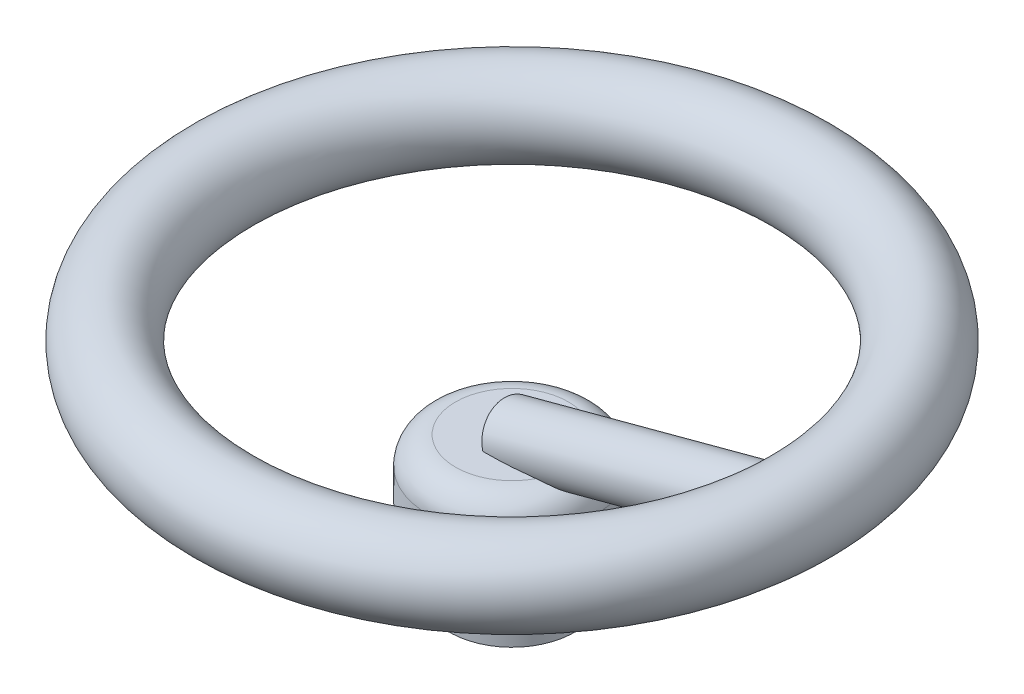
from build123d import *

# Parameters (mm, degrees)
SKETCH1_R                      = 8.734980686
BOSS_EXTRUDE3_REACH            = 104.166
BOSS_EXTRUDE3_END_MAJOR_RADIUS = 60.445848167
BOSS_EXTRUDE3_END_MINOR_RADIUS = 8.734980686
SKETCH2_R                      = 6.122900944


with BuildPart() as part:
    # Sketch1 → Revolve1 (revolve)
    with BuildSketch(Plane.XY, mode=Mode.PRIVATE) as revolve1_sk:
        with Locations((60.445848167, 17.075098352)):
            Circle(SKETCH1_R)
        with BuildLine():
            Line((0, 0), (11.862125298, 0))
            ThreePointArc((11.862125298, 0), (15.908862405, -1.676213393), (17.585075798, -5.7229505))
            Line((17.585075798, -5.7229505), (17.585075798, -12.382969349))
            Line((17.585075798, -12.382969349), (13.062097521, -12.382969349))
            Line((13.062097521, -12.382969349), (13.062097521, -29.427049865))
            Line((13.062097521, -29.427049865), (0, -29.427049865))
            Line((0, -29.427049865), (0, 0))
        make_face()
    revolve(revolve1_sk.sketch.rotate(Axis((0, 0, 0), (0, -1, 0)), 180), axis=Axis((0, 0, 0), (0, -1, 0)))

    # Boss-Extrude3: up to this torus (the profile starts outside it)
    boss_extrude3_end = Plane(origin=(0, 17.075098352, 0), z_dir=(0, 1, 0)) * Torus(BOSS_EXTRUDE3_END_MAJOR_RADIUS, BOSS_EXTRUDE3_END_MINOR_RADIUS, mode=Mode.PRIVATE)
    # Sketch2 → Boss-Extrude3 (add, up to the surface)
    with BuildSketch(Plane(origin=(0, 0, 0), x_dir=(-0.2588190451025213, 0.9659258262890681, 0), z_dir=(0.9659258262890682, 0.25881904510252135, 0)), mode=Mode.PRIVATE) as boss_extrude3_sk1:
        with Locations(Location((0, 0, 0), (0, 0, 243.601732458))):
            Circle(SKETCH2_R)
    boss_extrude3_tool1 = extrude(boss_extrude3_sk1.sketch, amount=BOSS_EXTRUDE3_REACH, mode=Mode.PRIVATE) - boss_extrude3_end
    add(boss_extrude3_tool1.solids().sort_by_distance((0, 0, 0))[0])


solid = part.part
